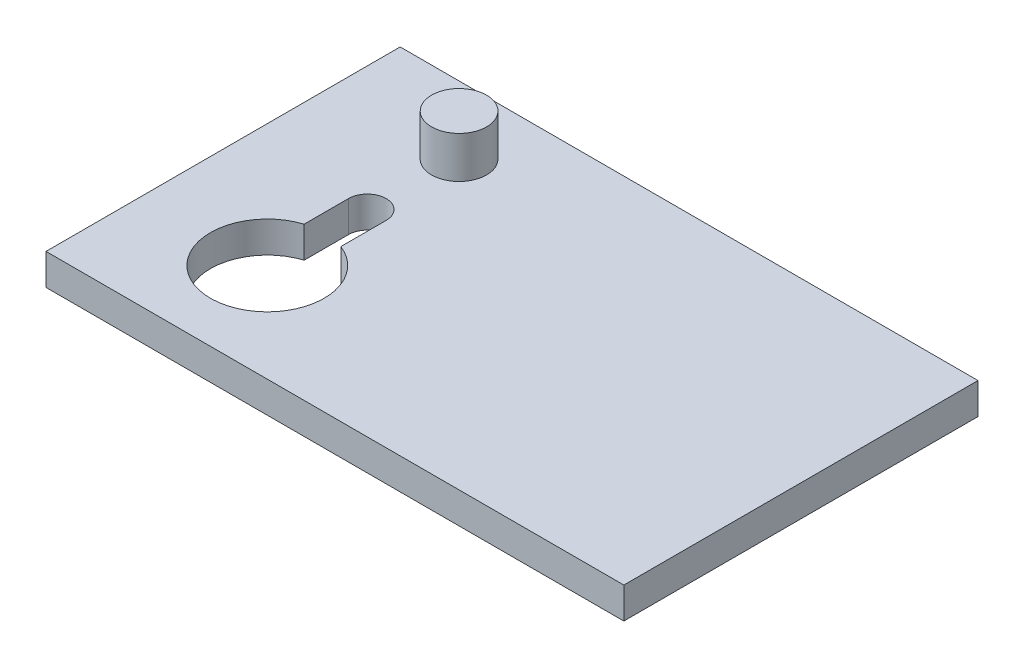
ISO-10303-21;
HEADER;
FILE_DESCRIPTION(('STEP AP214'),'2;1');
FILE_NAME('part.step','',(''),(''),'','','');
FILE_SCHEMA(('AUTOMOTIVE_DESIGN { 1 0 10303 214 1 1 1 1 }'));
ENDSEC;
DATA;
#1=APPLICATION_CONTEXT('core data for automotive mechanical design processes');
#2=APPLICATION_PROTOCOL_DEFINITION('international standard','automotive_design',2000,#1);
#3=PRODUCT_CONTEXT('',#1,'mechanical');
#4=PRODUCT('Part','Part','',(#3));
#5=PRODUCT_RELATED_PRODUCT_CATEGORY('part','',(#4));
#6=PRODUCT_DEFINITION_FORMATION('','',#4);
#7=PRODUCT_DEFINITION_CONTEXT('part definition',#1,'design');
#8=PRODUCT_DEFINITION('design','',#6,#7);
#9=PRODUCT_DEFINITION_SHAPE('','',#8);
#10=(LENGTH_UNIT() NAMED_UNIT(*) SI_UNIT(.MILLI.,.METRE.));
#11=(NAMED_UNIT(*) PLANE_ANGLE_UNIT() SI_UNIT($,.RADIAN.));
#12=(NAMED_UNIT(*) SI_UNIT($,.STERADIAN.) SOLID_ANGLE_UNIT());
#13=UNCERTAINTY_MEASURE_WITH_UNIT(LENGTH_MEASURE(1.E-05),#10,'distance_accuracy_value','');
#14=(GEOMETRIC_REPRESENTATION_CONTEXT(3) GLOBAL_UNCERTAINTY_ASSIGNED_CONTEXT((#13)) GLOBAL_UNIT_ASSIGNED_CONTEXT((#10,
#11,#12)) REPRESENTATION_CONTEXT('',''));
#15=CARTESIAN_POINT('',(0.,0.,0.));
#16=DIRECTION('',(0.,0.,1.));
#17=DIRECTION('',(1.,0.,0.));
#18=AXIS2_PLACEMENT_3D('',#15,#16,#17);
#19=CARTESIAN_POINT('',(-70.4701521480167,7.62,43.1913835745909));
#20=DIRECTION('',(0.,1.,0.));
#21=DIRECTION('',(0.,0.,1.));
#22=AXIS2_PLACEMENT_3D('',#19,#20,#21);
#23=PLANE('',#22);
#24=DIRECTION('',(0.,0.,1.));
#25=VECTOR('',#24,1.);
#26=CARTESIAN_POINT('',(-70.4701521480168,7.62,-43.1913835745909));
#27=LINE('',#26,#25);
#28=CARTESIAN_POINT('',(-70.4701521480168,7.62,-43.1913835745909));
#29=VERTEX_POINT('',#28);
#30=CARTESIAN_POINT('',(-70.4701521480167,7.62,43.1913835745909));
#31=VERTEX_POINT('',#30);
#32=EDGE_CURVE('E140',#29,#31,#27,.T.);
#33=ORIENTED_EDGE('',*,*,#32,.T.);
#34=DIRECTION('',(1.,0.,0.));
#35=VECTOR('',#34,1.);
#36=CARTESIAN_POINT('',(-70.4701521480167,7.62,43.1913835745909));
#37=LINE('',#36,#35);
#38=CARTESIAN_POINT('',(70.4701521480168,7.62,43.1913835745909));
#39=VERTEX_POINT('',#38);
#40=EDGE_CURVE('E143',#31,#39,#37,.T.);
#41=ORIENTED_EDGE('',*,*,#40,.T.);
#42=DIRECTION('',(0.,0.,-1.));
#43=VECTOR('',#42,1.);
#44=CARTESIAN_POINT('',(70.4701521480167,7.62,-43.1913835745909));
#45=LINE('',#44,#43);
#46=CARTESIAN_POINT('',(70.4701521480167,7.62,-43.1913835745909));
#47=VERTEX_POINT('',#46);
#48=EDGE_CURVE('E145',#39,#47,#45,.T.);
#49=ORIENTED_EDGE('',*,*,#48,.T.);
#50=DIRECTION('',(-1.,0.,0.));
#51=VECTOR('',#50,1.);
#52=CARTESIAN_POINT('',(-70.4701521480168,7.62,-43.1913835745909));
#53=LINE('',#52,#51);
#54=EDGE_CURVE('E147',#47,#29,#53,.T.);
#55=ORIENTED_EDGE('',*,*,#54,.T.);
#56=EDGE_LOOP('',(#33,#41,#49,#55));
#57=FACE_BOUND('',#56,.T.);
#58=CARTESIAN_POINT('',(-40.138558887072,7.62,-4.85771005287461));
#59=DIRECTION('',(0.,1.,0.));
#60=DIRECTION('',(0.,0.,1.));
#61=AXIS2_PLACEMENT_3D('',#58,#59,#60);
#62=CIRCLE('',#61,4.6049602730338);
#63=CARTESIAN_POINT('',(-35.5335986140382,7.62,-4.85771005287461));
#64=VERTEX_POINT('',#63);
#65=CARTESIAN_POINT('',(-44.7435191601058,7.62,-4.85771005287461));
#66=VERTEX_POINT('',#65);
#67=EDGE_CURVE('E46',#64,#66,#62,.T.);
#68=ORIENTED_EDGE('',*,*,#67,.F.);
#69=DIRECTION('',(0.,0.,-1.));
#70=VECTOR('',#69,1.);
#71=CARTESIAN_POINT('',(-35.5335986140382,7.62,-4.85771005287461));
#72=LINE('',#71,#70);
#73=CARTESIAN_POINT('',(-35.5335986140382,7.62,6.21563081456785));
#74=VERTEX_POINT('',#73);
#75=EDGE_CURVE('E113',#74,#64,#72,.T.);
#76=ORIENTED_EDGE('',*,*,#75,.F.);
#77=CARTESIAN_POINT('',(-40.513092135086,7.62,19.166828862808));
#78=DIRECTION('',(0.,1.,0.));
#79=DIRECTION('',(0.,0.,1.));
#80=AXIS2_PLACEMENT_3D('',#77,#78,#79);
#81=CIRCLE('',#80,13.8754778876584);
#82=CARTESIAN_POINT('',(-44.7435191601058,7.62,5.9519745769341));
#83=VERTEX_POINT('',#82);
#84=EDGE_CURVE('E98',#83,#74,#81,.T.);
#85=ORIENTED_EDGE('',*,*,#84,.F.);
#86=DIRECTION('',(0.,0.,1.));
#87=VECTOR('',#86,1.);
#88=CARTESIAN_POINT('',(-44.7435191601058,7.62,-4.85771005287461));
#89=LINE('',#88,#87);
#90=EDGE_CURVE('E107',#66,#83,#89,.T.);
#91=ORIENTED_EDGE('',*,*,#90,.F.);
#92=EDGE_LOOP('',(#68,#76,#85,#91));
#93=FACE_BOUND('',#92,.T.);
#94=CARTESIAN_POINT('',(-39.5900621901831,7.62,-26.6840507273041));
#95=DIRECTION('',(0.,1.,0.));
#96=DIRECTION('',(0.,0.,1.));
#97=AXIS2_PLACEMENT_3D('',#94,#95,#96);
#98=CIRCLE('',#97,6.70951587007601);
#99=CARTESIAN_POINT('',(-39.5900621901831,7.62,-19.9745348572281));
#100=VERTEX_POINT('',#99);
#101=EDGE_CURVE('E203',#100,#100,#98,.T.);
#102=ORIENTED_EDGE('',*,*,#101,.F.);
#103=EDGE_LOOP('',(#102));
#104=FACE_BOUND('',#103,.T.);
#105=ADVANCED_FACE('F31',(#57,#93,#104),#23,.T.);
#106=CARTESIAN_POINT('',(-70.4701521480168,7.62,-43.1913835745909));
#107=DIRECTION('',(1.,0.,0.));
#108=DIRECTION('',(0.,0.,-1.));
#109=AXIS2_PLACEMENT_3D('',#106,#107,#108);
#110=PLANE('',#109);
#111=DIRECTION('',(0.,0.,1.));
#112=VECTOR('',#111,1.);
#113=CARTESIAN_POINT('',(-70.4701521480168,0.,-43.1913835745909));
#114=LINE('',#113,#112);
#115=CARTESIAN_POINT('',(-70.4701521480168,0.,-43.1913835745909));
#116=VERTEX_POINT('',#115);
#117=CARTESIAN_POINT('',(-70.4701521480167,0.,43.1913835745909));
#118=VERTEX_POINT('',#117);
#119=EDGE_CURVE('E129',#116,#118,#114,.T.);
#120=ORIENTED_EDGE('',*,*,#119,.T.);
#121=DIRECTION('',(0.,-1.,0.));
#122=VECTOR('',#121,1.);
#123=CARTESIAN_POINT('',(-70.4701521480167,7.62,43.1913835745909));
#124=LINE('',#123,#122);
#125=EDGE_CURVE('E11',#31,#118,#124,.T.);
#126=ORIENTED_EDGE('',*,*,#125,.F.);
#127=ORIENTED_EDGE('',*,*,#32,.F.);
#128=DIRECTION('',(0.,-1.,0.));
#129=VECTOR('',#128,1.);
#130=CARTESIAN_POINT('',(-70.4701521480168,7.62,-43.1913835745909));
#131=LINE('',#130,#129);
#132=EDGE_CURVE('E149',#29,#116,#131,.T.);
#133=ORIENTED_EDGE('',*,*,#132,.T.);
#134=EDGE_LOOP('',(#120,#126,#127,#133));
#135=FACE_BOUND('',#134,.T.);
#136=ADVANCED_FACE('F33',(#135),#110,.F.);
#137=CARTESIAN_POINT('',(-70.4701521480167,7.62,43.1913835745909));
#138=DIRECTION('',(0.,0.,-1.));
#139=DIRECTION('',(-1.,0.,0.));
#140=AXIS2_PLACEMENT_3D('',#137,#138,#139);
#141=PLANE('',#140);
#142=DIRECTION('',(1.,0.,0.));
#143=VECTOR('',#142,1.);
#144=CARTESIAN_POINT('',(-70.4701521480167,0.,43.1913835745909));
#145=LINE('',#144,#143);
#146=CARTESIAN_POINT('',(70.4701521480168,0.,43.1913835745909));
#147=VERTEX_POINT('',#146);
#148=EDGE_CURVE('E134',#118,#147,#145,.T.);
#149=ORIENTED_EDGE('',*,*,#148,.T.);
#150=DIRECTION('',(0.,-1.,0.));
#151=VECTOR('',#150,1.);
#152=CARTESIAN_POINT('',(70.4701521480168,7.62,43.1913835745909));
#153=LINE('',#152,#151);
#154=EDGE_CURVE('E39',#39,#147,#153,.T.);
#155=ORIENTED_EDGE('',*,*,#154,.F.);
#156=ORIENTED_EDGE('',*,*,#40,.F.);
#157=ORIENTED_EDGE('',*,*,#125,.T.);
#158=EDGE_LOOP('',(#149,#155,#156,#157));
#159=FACE_BOUND('',#158,.T.);
#160=ADVANCED_FACE('F174',(#159),#141,.F.);
#161=CARTESIAN_POINT('',(70.4701521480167,7.62,-43.1913835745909));
#162=DIRECTION('',(-1.,0.,0.));
#163=DIRECTION('',(0.,0.,1.));
#164=AXIS2_PLACEMENT_3D('',#161,#162,#163);
#165=PLANE('',#164);
#166=DIRECTION('',(0.,0.,-1.));
#167=VECTOR('',#166,1.);
#168=CARTESIAN_POINT('',(70.4701521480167,0.,-43.1913835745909));
#169=LINE('',#168,#167);
#170=CARTESIAN_POINT('',(70.4701521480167,0.,-43.1913835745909));
#171=VERTEX_POINT('',#170);
#172=EDGE_CURVE('E136',#147,#171,#169,.T.);
#173=ORIENTED_EDGE('',*,*,#172,.T.);
#174=DIRECTION('',(0.,-1.,0.));
#175=VECTOR('',#174,1.);
#176=CARTESIAN_POINT('',(70.4701521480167,7.62,-43.1913835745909));
#177=LINE('',#176,#175);
#178=EDGE_CURVE('E152',#47,#171,#177,.T.);
#179=ORIENTED_EDGE('',*,*,#178,.F.);
#180=ORIENTED_EDGE('',*,*,#48,.F.);
#181=ORIENTED_EDGE('',*,*,#154,.T.);
#182=EDGE_LOOP('',(#173,#179,#180,#181));
#183=FACE_BOUND('',#182,.T.);
#184=ADVANCED_FACE('F159',(#183),#165,.F.);
#185=CARTESIAN_POINT('',(-70.4701521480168,7.62,-43.1913835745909));
#186=DIRECTION('',(0.,0.,1.));
#187=DIRECTION('',(1.,0.,0.));
#188=AXIS2_PLACEMENT_3D('',#185,#186,#187);
#189=PLANE('',#188);
#190=DIRECTION('',(-1.,0.,0.));
#191=VECTOR('',#190,1.);
#192=CARTESIAN_POINT('',(-70.4701521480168,0.,-43.1913835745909));
#193=LINE('',#192,#191);
#194=EDGE_CURVE('E138',#171,#116,#193,.T.);
#195=ORIENTED_EDGE('',*,*,#194,.T.);
#196=ORIENTED_EDGE('',*,*,#132,.F.);
#197=ORIENTED_EDGE('',*,*,#54,.F.);
#198=ORIENTED_EDGE('',*,*,#178,.T.);
#199=EDGE_LOOP('',(#195,#196,#197,#198));
#200=FACE_BOUND('',#199,.T.);
#201=ADVANCED_FACE('F168',(#200),#189,.F.);
#202=CARTESIAN_POINT('',(-70.4701521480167,0.,43.1913835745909));
#203=DIRECTION('',(0.,1.,0.));
#204=DIRECTION('',(0.,0.,1.));
#205=AXIS2_PLACEMENT_3D('',#202,#203,#204);
#206=PLANE('',#205);
#207=DIRECTION('',(0.,0.,-1.));
#208=VECTOR('',#207,1.);
#209=CARTESIAN_POINT('',(-35.5335986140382,0.,-4.85771005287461));
#210=LINE('',#209,#208);
#211=CARTESIAN_POINT('',(-35.5335986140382,0.,6.21563081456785));
#212=VERTEX_POINT('',#211);
#213=CARTESIAN_POINT('',(-35.5335986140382,0.,-4.85771005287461));
#214=VERTEX_POINT('',#213);
#215=EDGE_CURVE('E124',#212,#214,#210,.T.);
#216=ORIENTED_EDGE('',*,*,#215,.T.);
#217=CARTESIAN_POINT('',(-40.138558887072,0.,-4.85771005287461));
#218=DIRECTION('',(0.,1.,0.));
#219=DIRECTION('',(0.,0.,1.));
#220=AXIS2_PLACEMENT_3D('',#217,#218,#219);
#221=CIRCLE('',#220,4.6049602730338);
#222=CARTESIAN_POINT('',(-44.7435191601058,0.,-4.85771005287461));
#223=VERTEX_POINT('',#222);
#224=EDGE_CURVE('E115',#214,#223,#221,.T.);
#225=ORIENTED_EDGE('',*,*,#224,.T.);
#226=DIRECTION('',(0.,0.,1.));
#227=VECTOR('',#226,1.);
#228=CARTESIAN_POINT('',(-44.7435191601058,0.,-4.85771005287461));
#229=LINE('',#228,#227);
#230=CARTESIAN_POINT('',(-44.7435191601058,0.,5.9519745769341));
#231=VERTEX_POINT('',#230);
#232=EDGE_CURVE('E121',#223,#231,#229,.T.);
#233=ORIENTED_EDGE('',*,*,#232,.T.);
#234=CARTESIAN_POINT('',(-40.513092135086,0.,19.166828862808));
#235=DIRECTION('',(0.,1.,0.));
#236=DIRECTION('',(0.,0.,1.));
#237=AXIS2_PLACEMENT_3D('',#234,#235,#236);
#238=CIRCLE('',#237,13.8754778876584);
#239=EDGE_CURVE('E54',#231,#212,#238,.T.);
#240=ORIENTED_EDGE('',*,*,#239,.T.);
#241=EDGE_LOOP('',(#216,#225,#233,#240));
#242=FACE_BOUND('',#241,.T.);
#243=ORIENTED_EDGE('',*,*,#119,.F.);
#244=ORIENTED_EDGE('',*,*,#194,.F.);
#245=ORIENTED_EDGE('',*,*,#172,.F.);
#246=ORIENTED_EDGE('',*,*,#148,.F.);
#247=EDGE_LOOP('',(#243,#244,#245,#246));
#248=FACE_BOUND('',#247,.T.);
#249=ADVANCED_FACE('F165',(#242,#248),#206,.F.);
#250=CARTESIAN_POINT('',(-40.138558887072,0.,-4.85771005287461));
#251=DIRECTION('',(0.,1.,0.));
#252=DIRECTION('',(0.,0.,1.));
#253=AXIS2_PLACEMENT_3D('',#250,#251,#252);
#254=CYLINDRICAL_SURFACE('',#253,4.6049602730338);
#255=ORIENTED_EDGE('',*,*,#67,.T.);
#256=DIRECTION('',(0.,1.,0.));
#257=VECTOR('',#256,1.);
#258=CARTESIAN_POINT('',(-44.7435191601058,0.,-4.85771005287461));
#259=LINE('',#258,#257);
#260=EDGE_CURVE('E104',#223,#66,#259,.T.);
#261=ORIENTED_EDGE('',*,*,#260,.F.);
#262=ORIENTED_EDGE('',*,*,#224,.F.);
#263=DIRECTION('',(0.,1.,0.));
#264=VECTOR('',#263,1.);
#265=CARTESIAN_POINT('',(-35.5335986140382,0.,-4.85771005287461));
#266=LINE('',#265,#264);
#267=EDGE_CURVE('E127',#214,#64,#266,.T.);
#268=ORIENTED_EDGE('',*,*,#267,.T.);
#269=EDGE_LOOP('',(#255,#261,#262,#268));
#270=FACE_BOUND('',#269,.T.);
#271=ADVANCED_FACE('F192',(#270),#254,.F.);
#272=CARTESIAN_POINT('',(-35.5335986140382,0.,-4.85771005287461));
#273=DIRECTION('',(1.,0.,0.));
#274=DIRECTION('',(0.,0.,-1.));
#275=AXIS2_PLACEMENT_3D('',#272,#273,#274);
#276=PLANE('',#275);
#277=ORIENTED_EDGE('',*,*,#75,.T.);
#278=ORIENTED_EDGE('',*,*,#267,.F.);
#279=ORIENTED_EDGE('',*,*,#215,.F.);
#280=DIRECTION('',(0.,1.,0.));
#281=VECTOR('',#280,1.);
#282=CARTESIAN_POINT('',(-35.5335986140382,0.,6.21563081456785));
#283=LINE('',#282,#281);
#284=EDGE_CURVE('E103',#212,#74,#283,.T.);
#285=ORIENTED_EDGE('',*,*,#284,.T.);
#286=EDGE_LOOP('',(#277,#278,#279,#285));
#287=FACE_BOUND('',#286,.T.);
#288=ADVANCED_FACE('F197',(#287),#276,.F.);
#289=CARTESIAN_POINT('',(-40.513092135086,0.,19.166828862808));
#290=DIRECTION('',(0.,1.,0.));
#291=DIRECTION('',(0.,0.,1.));
#292=AXIS2_PLACEMENT_3D('',#289,#290,#291);
#293=CYLINDRICAL_SURFACE('',#292,13.8754778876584);
#294=ORIENTED_EDGE('',*,*,#84,.T.);
#295=ORIENTED_EDGE('',*,*,#284,.F.);
#296=ORIENTED_EDGE('',*,*,#239,.F.);
#297=DIRECTION('',(0.,1.,0.));
#298=VECTOR('',#297,1.);
#299=CARTESIAN_POINT('',(-44.7435191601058,0.,5.9519745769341));
#300=LINE('',#299,#298);
#301=EDGE_CURVE('E94',#231,#83,#300,.T.);
#302=ORIENTED_EDGE('',*,*,#301,.T.);
#303=EDGE_LOOP('',(#294,#295,#296,#302));
#304=FACE_BOUND('',#303,.T.);
#305=ADVANCED_FACE('F96',(#304),#293,.F.);
#306=CARTESIAN_POINT('',(-44.7435191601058,0.,-4.85771005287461));
#307=DIRECTION('',(-1.,0.,0.));
#308=DIRECTION('',(0.,0.,1.));
#309=AXIS2_PLACEMENT_3D('',#306,#307,#308);
#310=PLANE('',#309);
#311=ORIENTED_EDGE('',*,*,#90,.T.);
#312=ORIENTED_EDGE('',*,*,#301,.F.);
#313=ORIENTED_EDGE('',*,*,#232,.F.);
#314=ORIENTED_EDGE('',*,*,#260,.T.);
#315=EDGE_LOOP('',(#311,#312,#313,#314));
#316=FACE_BOUND('',#315,.T.);
#317=ADVANCED_FACE('F108',(#316),#310,.F.);
#318=CARTESIAN_POINT('',(-39.5900621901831,17.78,-26.6840507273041));
#319=DIRECTION('',(0.,-1.,0.));
#320=DIRECTION('',(0.,0.,-1.));
#321=AXIS2_PLACEMENT_3D('',#318,#319,#320);
#322=CYLINDRICAL_SURFACE('',#321,6.70951587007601);
#323=CARTESIAN_POINT('',(-39.5900621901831,17.78,-26.6840507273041));
#324=DIRECTION('',(0.,1.,0.));
#325=DIRECTION('',(0.,0.,1.));
#326=AXIS2_PLACEMENT_3D('',#323,#324,#325);
#327=CIRCLE('',#326,6.70951587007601);
#328=CARTESIAN_POINT('',(-39.5900621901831,17.78,-19.9745348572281));
#329=VERTEX_POINT('',#328);
#330=EDGE_CURVE('E201',#329,#329,#327,.T.);
#331=ORIENTED_EDGE('',*,*,#330,.F.);
#332=EDGE_LOOP('',(#331));
#333=FACE_BOUND('',#332,.T.);
#334=ORIENTED_EDGE('',*,*,#101,.T.);
#335=EDGE_LOOP('',(#334));
#336=FACE_BOUND('',#335,.T.);
#337=ADVANCED_FACE('F209',(#333,#336),#322,.T.);
#338=CARTESIAN_POINT('',(-39.5900621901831,17.78,-26.6840507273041));
#339=DIRECTION('',(0.,1.,0.));
#340=DIRECTION('',(0.,0.,1.));
#341=AXIS2_PLACEMENT_3D('',#338,#339,#340);
#342=PLANE('',#341);
#343=ORIENTED_EDGE('',*,*,#330,.T.);
#344=EDGE_LOOP('',(#343));
#345=FACE_BOUND('',#344,.T.);
#346=ADVANCED_FACE('F211',(#345),#342,.T.);
#347=CLOSED_SHELL('',(#105,#136,#160,#184,#201,#249,#271,#288,#305,#317,#337,#346));
#348=MANIFOLD_SOLID_BREP('B2',#347);
#349=ADVANCED_BREP_SHAPE_REPRESENTATION('',(#18,#348),#14);
#350=SHAPE_DEFINITION_REPRESENTATION(#9,#349);
ENDSEC;
END-ISO-10303-21;
